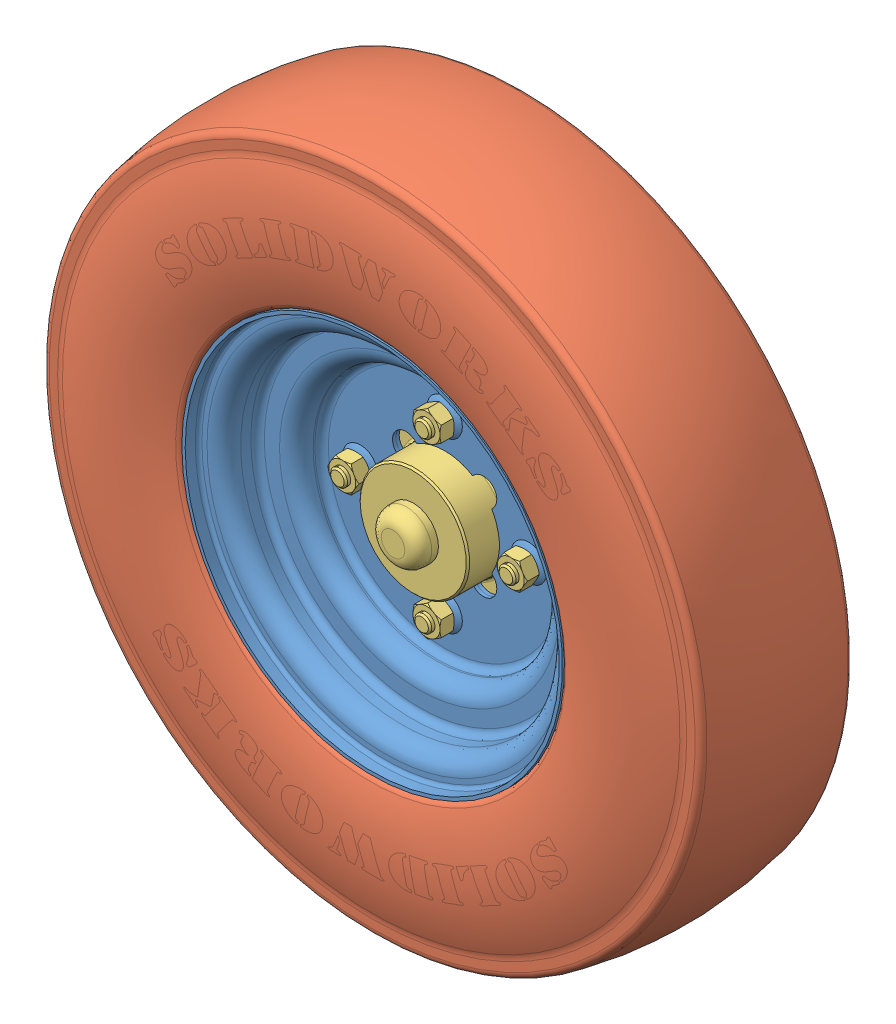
SolidWorks assembly Wheel.SLDASM, configuration Default (file format 11000). Lengths in mm.
Overall size (400 400 149.77).
3 component instances, 3 part files, 3 mates.
Components (placement in the parent):
- Wheel-1: Wheel.SLDPRT [Default] at origin size (226 226 90)
- Tyre-2: Tyre.SLDPRT [Default] at origin size (400 400 105.09)
- Hub-2: Hub.SLDPRT [Default] at origin size (140 140 129)
Mates (geometry in assembly coordinates):
- Concentric1: concentric: cylinder of Wheel-1 through (0 0 0) axis (0 0 -1) radius 32.5; cylinder of Hub-2 through (0 0 -10.3649) axis (0 0 1) radius 32.5
- Concentric2: concentric: cylinder of Wheel-1 through (0 50 0) axis (0 0 -1) radius 5; cylinder of Hub-2 through (0 50 15.6351) axis (0 0 -1) radius 5
- Coincident1: coincident: circle of Wheel-1; plane of Hub-2 through (0 70 -4.3649) normal (0 0 1)
